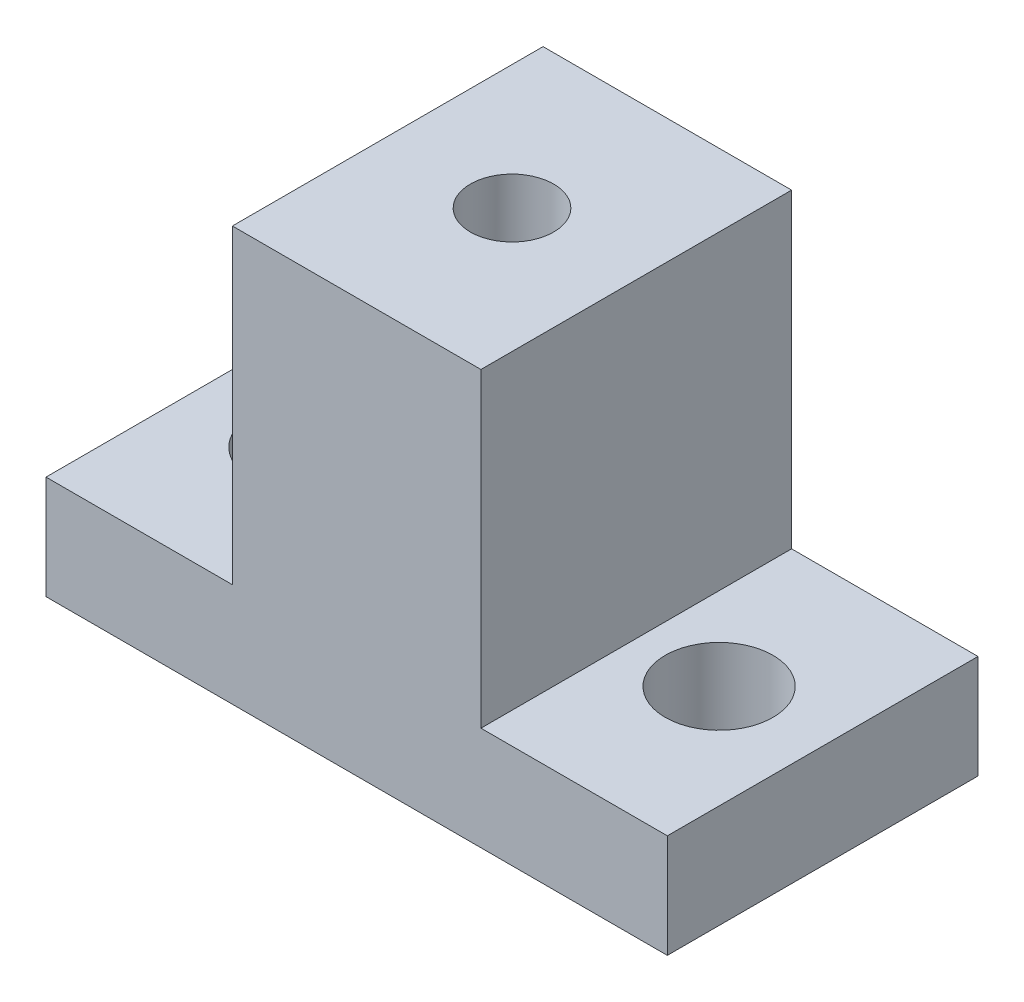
from build123d import *

# Parameters (mm, degrees)
SKETCH1_W               = 38.1
SKETCH1_H               = 19.05
BOSS_EXTRUDE1_DEPTH     = 12.7
SKETCH2_W               = 11.43
SKETCH2_H               = 19.05
CUT_EXTRUDE1_DEPTH      = 30.784140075
SKETCH3_R               = 3.302
CUT_EXTRUDE2_DEPTH      = 29.575
SKETCH7_R               = 6.35
CUT_EXTRUDE6_DEPTH      = 19.05
F_1_4_20_TAPPED_HOLE2_D = 5.1054


with BuildPart() as part:
    # Sketch1 → Boss-Extrude1 (new, symmetric)
    with BuildSketch(Plane(origin=(0, 0, 0), x_dir=(1, 0, 0), z_dir=(0, 1, 0))):
        Rectangle(SKETCH1_W, SKETCH1_H)
    extrude(amount=BOSS_EXTRUDE1_DEPTH, both=True)

    # Sketch2 → Cut-Extrude1 (cut, through all)
    with BuildSketch(Plane.XY.offset(9.525)):
        with Locations((-13.335, 3.175)):
            Rectangle(SKETCH2_W, SKETCH2_H)
    cut_extrude1 = extrude(amount=-CUT_EXTRUDE1_DEPTH, mode=Mode.SUBTRACT)

    # Sketch3 → Cut-Extrude2 (cut, through all)
    with BuildSketch(Plane(origin=(0, -6.35, 0), x_dir=(1, 0, 0), z_dir=(0, 1, 0))):
        with Locations(Location((-12.7, 0, 0), (0, 0, 270))):
            Circle(SKETCH3_R)
    cut_extrude2 = extrude(amount=-CUT_EXTRUDE2_DEPTH, mode=Mode.SUBTRACT)

    # Mirror1: Cut-Extrude1, Cut-Extrude2 across plane
    add(cut_extrude1.mirror(Plane(origin=(0, 0, 0), x_dir=(0, 0, 1), z_dir=(1, 0, 0))), mode=Mode.SUBTRACT)
    add(cut_extrude2.mirror(Plane(origin=(0, 0, 0), x_dir=(0, 0, 1), z_dir=(1, 0, 0))), mode=Mode.SUBTRACT)

    # Sketch7 → Cut-Extrude6 (cut)
    with BuildSketch(Plane.XZ.offset(12.7)):
        with Locations(Location((0, 0, 0), (0, 0, 270))):
            Circle(SKETCH7_R)
    extrude(amount=-CUT_EXTRUDE6_DEPTH, mode=Mode.SUBTRACT)

    # 1_4-20 Tapped Hole2 (through all)
    with Locations(Plane(origin=(0, 12.7, 0), x_dir=(1, 0, 0), z_dir=(0, 1, 0))):
        with Locations((0, 0)):
            Hole(F_1_4_20_TAPPED_HOLE2_D / 2)


solid = part.part
